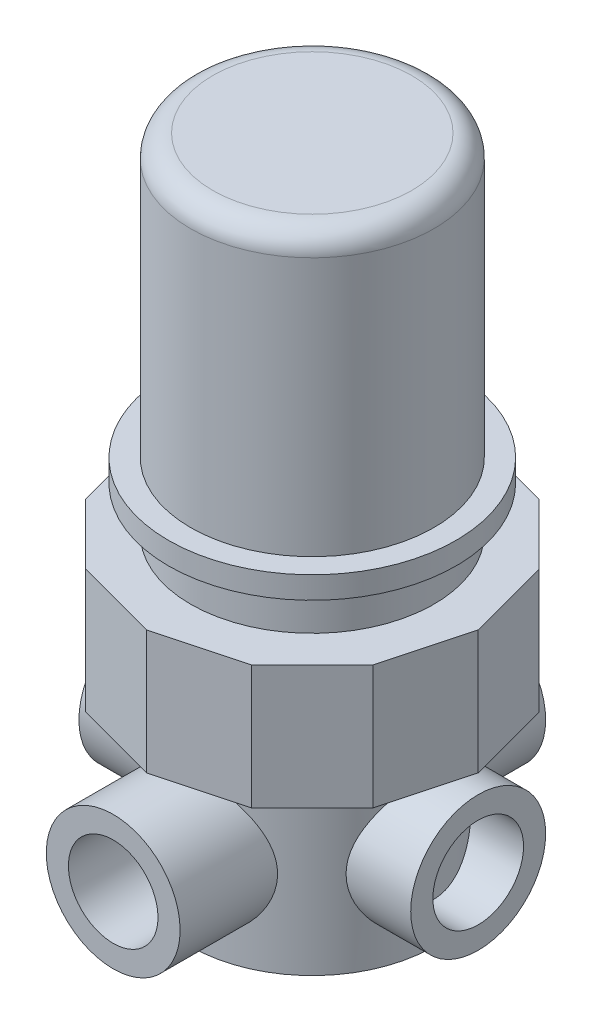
from build123d import *

# Parameters (mm, degrees)
CUT_EXTRUDE1_START       = -14.224
CUT_EXTRUDE1_DEPTH       = 14.224
BOSS_EXTRUDE1_DEPTH      = 8.89
BOSS_EXTRUDE1_DEPTH_BACK = 8.89
SKETCH3_R                = 7.6835
SKETCH3_R_2              = 5.1435
SKETCH4_R                = 7.747
SKETCH4_R_2              = 5.207
BOSS_EXTRUDE2_DEPTH      = 5.08
CIRPATTERN1_COUNT        = 4
FILLET1_R                = 2.54


with BuildPart() as part:
    # Sketch1 → Revolve1 (revolve)
    with BuildSketch(Plane.XY, mode=Mode.PRIVATE) as revolve1_sk:
        Polygon((0, 73.914), (13.97, 73.914), (13.97, 41.656), (16.51, 41.656), (16.51, 39.116), (13.97, 39.116), (13.97, 34.036), (19.05, 34.036), (19.05, 19.812), (13.97, 19.812), (13.97, 0), (0, 0), align=None)
    revolve(revolve1_sk.sketch.rotate(Axis((0, 73.914, 0), (0, -1, 0)), 90), axis=Axis((0, 73.914, 0), (0, -1, 0)))

    # Sketch2 → Cut-Extrude1 (cut)
    with BuildSketch(Plane(origin=(0, 34.036, 0), x_dir=(1, 0, 0), z_dir=(0, 1, 0)).offset(CUT_EXTRUDE1_START)):
        with BuildLine():
            ThreePointArc((9.525, 16.497783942), (4.930502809, 18.400886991), (0, 19.05))
            Line((0, 19.05), (9.525, 16.497783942))
        make_face()
        with BuildLine():
            Line((-9.525, 16.497783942), (0, 19.05))
            ThreePointArc((0, 19.05), (-4.930502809, 18.400886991), (-9.525, 16.497783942))
        make_face()
        with BuildLine():
            Line((-16.497783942, 9.525), (-9.525, 16.497783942))
            ThreePointArc((-9.525, 16.497783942), (-13.470384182, 13.470384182), (-16.497783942, 9.525))
        make_face()
        with BuildLine():
            ThreePointArc((16.497783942, 9.525), (13.470384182, 13.470384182), (9.525, 16.497783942))
            Line((9.525, 16.497783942), (16.497783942, 9.525))
        make_face()
        with BuildLine():
            Line((-19.05, 0), (-16.497783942, 9.525))
            ThreePointArc((-16.497783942, 9.525), (-18.400886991, 4.930502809), (-19.05, 0))
        make_face()
        with BuildLine():
            ThreePointArc((19.05, 0), (18.400886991, 4.930502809), (16.497783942, 9.525))
            Line((16.497783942, 9.525), (19.05, 0))
        make_face()
        with BuildLine():
            Line((-16.497783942, -9.525), (-19.05, 0))
            ThreePointArc((-19.05, 0), (-18.400886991, -4.930502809), (-16.497783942, -9.525))
        make_face()
        with BuildLine():
            ThreePointArc((16.497783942, -9.525), (18.400886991, -4.930502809), (19.05, 0))
            Line((19.05, 0), (16.497783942, -9.525))
        make_face()
        with BuildLine():
            Line((-9.525, -16.497783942), (-16.497783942, -9.525))
            ThreePointArc((-16.497783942, -9.525), (-13.470384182, -13.470384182), (-9.525, -16.497783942))
        make_face()
        with BuildLine():
            ThreePointArc((9.525, -16.497783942), (13.470384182, -13.470384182), (16.497783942, -9.525))
            Line((16.497783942, -9.525), (9.525, -16.497783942))
        make_face()
        with BuildLine():
            Line((0, -19.05), (-9.525, -16.497783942))
            ThreePointArc((-9.525, -16.497783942), (-4.930502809, -18.400886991), (0, -19.05))
        make_face()
        with BuildLine():
            ThreePointArc((0, -19.05), (4.930502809, -18.400886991), (9.525, -16.497783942))
            Line((9.525, -16.497783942), (0, -19.05))
        make_face()
    extrude(amount=CUT_EXTRUDE1_DEPTH, mode=Mode.SUBTRACT)

    # Sketch3 → Boss-Extrude1 (add, two sides: drawn at the far end of the back side and taken through both)
    with BuildSketch(Plane.XY.offset(13.97).offset(-BOSS_EXTRUDE1_DEPTH_BACK)):
        with Locations(Location((0, 9.906, 0), (0, 0, 270))):
            Circle(SKETCH3_R)
        with Locations((0, 9.906)):
            Circle(SKETCH3_R_2, mode=Mode.SUBTRACT)
    extrude(amount=BOSS_EXTRUDE1_DEPTH + BOSS_EXTRUDE1_DEPTH_BACK)

    # Sketch4 → Boss-Extrude2 (add, symmetric)
    with BuildSketch(Plane(origin=(13.97, 0, 0), x_dir=(0, 0, -1), z_dir=(1, 0, 0))):
        with Locations(Location((0, 9.906, 0), (0, 0, 180))):
            Circle(SKETCH4_R)
        with Locations((0, 9.906)):
            Circle(SKETCH4_R_2, mode=Mode.SUBTRACT)
    boss_extrude2 = extrude(amount=BOSS_EXTRUDE2_DEPTH, both=True)

    # CirPattern1: Boss-Extrude2 ×4 about axis, 1 skipped
    cirpattern1_axis = Axis((0, 73.914, 0), (0, -1, 0))
    add([boss_extrude2.rotate(cirpattern1_axis, i * 360 / CIRPATTERN1_COUNT) for i in range(1, CIRPATTERN1_COUNT) if i not in (1,)])

    # Fillet1
    fillet1_edges = [part.edges().sort_by_distance(p)[0] for p in [
        (0, 73.914, -13.97),
    ]]
    fillet(fillet1_edges, radius=FILLET1_R)


solid = part.part
